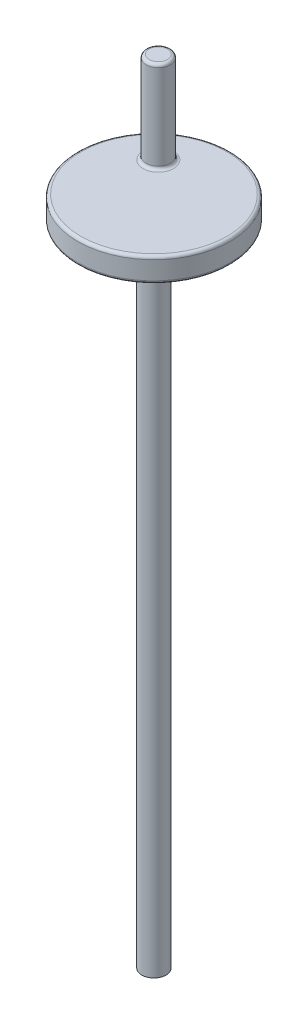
ISO-10303-21;
HEADER;
FILE_DESCRIPTION(('STEP AP214'),'2;1');
FILE_NAME('part.step','',(''),(''),'','','');
FILE_SCHEMA(('AUTOMOTIVE_DESIGN { 1 0 10303 214 1 1 1 1 }'));
ENDSEC;
DATA;
#1=APPLICATION_CONTEXT('core data for automotive mechanical design processes');
#2=APPLICATION_PROTOCOL_DEFINITION('international standard','automotive_design',2000,#1);
#3=PRODUCT_CONTEXT('',#1,'mechanical');
#4=PRODUCT('Part','Part','',(#3));
#5=PRODUCT_RELATED_PRODUCT_CATEGORY('part','',(#4));
#6=PRODUCT_DEFINITION_FORMATION('','',#4);
#7=PRODUCT_DEFINITION_CONTEXT('part definition',#1,'design');
#8=PRODUCT_DEFINITION('design','',#6,#7);
#9=PRODUCT_DEFINITION_SHAPE('','',#8);
#10=(LENGTH_UNIT() NAMED_UNIT(*) SI_UNIT(.MILLI.,.METRE.));
#11=(NAMED_UNIT(*) PLANE_ANGLE_UNIT() SI_UNIT($,.RADIAN.));
#12=(NAMED_UNIT(*) SI_UNIT($,.STERADIAN.) SOLID_ANGLE_UNIT());
#13=UNCERTAINTY_MEASURE_WITH_UNIT(LENGTH_MEASURE(1.E-05),#10,'distance_accuracy_value','');
#14=(GEOMETRIC_REPRESENTATION_CONTEXT(3) GLOBAL_UNCERTAINTY_ASSIGNED_CONTEXT((#13)) GLOBAL_UNIT_ASSIGNED_CONTEXT((#10,
#11,#12)) REPRESENTATION_CONTEXT('',''));
#15=CARTESIAN_POINT('',(0.,0.,0.));
#16=DIRECTION('',(0.,0.,1.));
#17=DIRECTION('',(1.,0.,0.));
#18=AXIS2_PLACEMENT_3D('',#15,#16,#17);
#19=CARTESIAN_POINT('',(0.,220.,0.));
#20=DIRECTION('',(0.,1.,0.));
#21=DIRECTION('',(0.,0.,1.));
#22=AXIS2_PLACEMENT_3D('',#19,#20,#21);
#23=PLANE('',#22);
#24=CARTESIAN_POINT('',(0.,220.,0.));
#25=DIRECTION('',(0.,1.,0.));
#26=DIRECTION('',(0.,0.,1.));
#27=AXIS2_PLACEMENT_3D('',#24,#25,#26);
#28=CIRCLE('',#27,24.);
#29=CARTESIAN_POINT('',(0.,220.,24.));
#30=VERTEX_POINT('',#29);
#31=EDGE_CURVE('E10',#30,#30,#28,.T.);
#32=ORIENTED_EDGE('',*,*,#31,.T.);
#33=EDGE_LOOP('',(#32));
#34=FACE_BOUND('',#33,.T.);
#35=CARTESIAN_POINT('',(-9.02736603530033,220.,-10.4682159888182));
#36=DIRECTION('',(0.,1.,0.));
#37=DIRECTION('',(0.,0.,1.));
#38=AXIS2_PLACEMENT_3D('',#35,#36,#37);
#39=CIRCLE('',#38,5.);
#40=CARTESIAN_POINT('',(-9.02736603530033,220.,-5.46821598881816));
#41=VERTEX_POINT('',#40);
#42=EDGE_CURVE('E37',#41,#41,#39,.F.);
#43=ORIENTED_EDGE('',*,*,#42,.T.);
#44=EDGE_LOOP('',(#43));
#45=FACE_BOUND('',#44,.T.);
#46=ADVANCED_FACE('F30',(#34,#45),#23,.T.);
#47=CARTESIAN_POINT('',(0.,220.,0.));
#48=DIRECTION('',(0.,-1.,0.));
#49=DIRECTION('',(0.,0.,-1.));
#50=AXIS2_PLACEMENT_3D('',#47,#48,#49);
#51=CYLINDRICAL_SURFACE('',#50,4.);
#52=CARTESIAN_POINT('',(0.,0.,0.));
#53=DIRECTION('',(0.,1.,0.));
#54=DIRECTION('',(0.,0.,1.));
#55=AXIS2_PLACEMENT_3D('',#52,#53,#54);
#56=CIRCLE('',#55,4.);
#57=CARTESIAN_POINT('',(0.,0.,4.));
#58=VERTEX_POINT('',#57);
#59=EDGE_CURVE('E65',#58,#58,#56,.T.);
#60=ORIENTED_EDGE('',*,*,#59,.T.);
#61=EDGE_LOOP('',(#60));
#62=FACE_BOUND('',#61,.T.);
#63=CARTESIAN_POINT('',(0.,212.,0.));
#64=DIRECTION('',(0.,1.,0.));
#65=DIRECTION('',(0.,0.,1.));
#66=AXIS2_PLACEMENT_3D('',#63,#64,#65);
#67=CIRCLE('',#66,4.);
#68=CARTESIAN_POINT('',(0.,212.,4.));
#69=VERTEX_POINT('',#68);
#70=EDGE_CURVE('E62',#69,#69,#67,.T.);
#71=ORIENTED_EDGE('',*,*,#70,.F.);
#72=EDGE_LOOP('',(#71));
#73=FACE_BOUND('',#72,.T.);
#74=ADVANCED_FACE('F69',(#62,#73),#51,.T.);
#75=CARTESIAN_POINT('',(0.,0.,0.));
#76=DIRECTION('',(0.,1.,0.));
#77=DIRECTION('',(0.,0.,1.));
#78=AXIS2_PLACEMENT_3D('',#75,#76,#77);
#79=PLANE('',#78);
#80=ORIENTED_EDGE('',*,*,#59,.F.);
#81=EDGE_LOOP('',(#80));
#82=FACE_BOUND('',#81,.T.);
#83=ADVANCED_FACE('F72',(#82),#79,.F.);
#84=CARTESIAN_POINT('',(0.,212.,0.));
#85=DIRECTION('',(0.,1.,0.));
#86=DIRECTION('',(0.,0.,1.));
#87=AXIS2_PLACEMENT_3D('',#84,#85,#86);
#88=PLANE('',#87);
#89=CARTESIAN_POINT('',(0.,212.,0.));
#90=DIRECTION('',(0.,1.,0.));
#91=DIRECTION('',(0.,0.,1.));
#92=AXIS2_PLACEMENT_3D('',#89,#90,#91);
#93=CIRCLE('',#92,24.);
#94=CARTESIAN_POINT('',(0.,212.,24.));
#95=VERTEX_POINT('',#94);
#96=EDGE_CURVE('E41',#95,#95,#93,.F.);
#97=ORIENTED_EDGE('',*,*,#96,.T.);
#98=EDGE_LOOP('',(#97));
#99=FACE_BOUND('',#98,.T.);
#100=ORIENTED_EDGE('',*,*,#70,.T.);
#101=EDGE_LOOP('',(#100));
#102=FACE_BOUND('',#101,.T.);
#103=ADVANCED_FACE('F74',(#99,#102),#88,.F.);
#104=CARTESIAN_POINT('',(0.,212.,0.));
#105=DIRECTION('',(0.,1.,0.));
#106=DIRECTION('',(0.,0.,1.));
#107=AXIS2_PLACEMENT_3D('',#104,#105,#106);
#108=CYLINDRICAL_SURFACE('',#107,25.);
#109=CARTESIAN_POINT('',(0.,213.,0.));
#110=DIRECTION('',(0.,1.,0.));
#111=DIRECTION('',(0.,0.,1.));
#112=AXIS2_PLACEMENT_3D('',#109,#110,#111);
#113=CIRCLE('',#112,25.);
#114=CARTESIAN_POINT('',(0.,213.,25.));
#115=VERTEX_POINT('',#114);
#116=EDGE_CURVE('E45',#115,#115,#113,.T.);
#117=ORIENTED_EDGE('',*,*,#116,.T.);
#118=EDGE_LOOP('',(#117));
#119=FACE_BOUND('',#118,.T.);
#120=CARTESIAN_POINT('',(0.,219.,0.));
#121=DIRECTION('',(0.,1.,0.));
#122=DIRECTION('',(0.,0.,1.));
#123=AXIS2_PLACEMENT_3D('',#120,#121,#122);
#124=CIRCLE('',#123,25.);
#125=CARTESIAN_POINT('',(0.,219.,25.));
#126=VERTEX_POINT('',#125);
#127=EDGE_CURVE('E50',#126,#126,#124,.F.);
#128=ORIENTED_EDGE('',*,*,#127,.T.);
#129=EDGE_LOOP('',(#128));
#130=FACE_BOUND('',#129,.T.);
#131=ADVANCED_FACE('F80',(#119,#130),#108,.T.);
#132=CARTESIAN_POINT('',(-9.02736603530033,250.,-10.4682159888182));
#133=DIRECTION('',(0.,-1.,0.));
#134=DIRECTION('',(0.,0.,-1.));
#135=AXIS2_PLACEMENT_3D('',#132,#133,#134);
#136=CYLINDRICAL_SURFACE('',#135,4.);
#137=CARTESIAN_POINT('',(-9.02736603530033,249.,-10.4682159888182));
#138=DIRECTION('',(0.,1.,0.));
#139=DIRECTION('',(0.,0.,1.));
#140=AXIS2_PLACEMENT_3D('',#137,#138,#139);
#141=CIRCLE('',#140,4.);
#142=CARTESIAN_POINT('',(-9.02736603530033,249.,-6.46821598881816));
#143=VERTEX_POINT('',#142);
#144=EDGE_CURVE('E53',#143,#143,#141,.F.);
#145=ORIENTED_EDGE('',*,*,#144,.T.);
#146=EDGE_LOOP('',(#145));
#147=FACE_BOUND('',#146,.T.);
#148=CARTESIAN_POINT('',(-9.02736603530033,221.,-10.4682159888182));
#149=DIRECTION('',(0.,1.,0.));
#150=DIRECTION('',(0.,0.,1.));
#151=AXIS2_PLACEMENT_3D('',#148,#149,#150);
#152=CIRCLE('',#151,4.);
#153=CARTESIAN_POINT('',(-9.02736603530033,221.,-6.46821598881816));
#154=VERTEX_POINT('',#153);
#155=EDGE_CURVE('E56',#154,#154,#152,.T.);
#156=ORIENTED_EDGE('',*,*,#155,.T.);
#157=EDGE_LOOP('',(#156));
#158=FACE_BOUND('',#157,.T.);
#159=ADVANCED_FACE('F90',(#147,#158),#136,.T.);
#160=CARTESIAN_POINT('',(-9.02736603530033,250.,-10.4682159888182));
#161=DIRECTION('',(0.,1.,0.));
#162=DIRECTION('',(0.,0.,1.));
#163=AXIS2_PLACEMENT_3D('',#160,#161,#162);
#164=PLANE('',#163);
#165=CARTESIAN_POINT('',(-9.02736603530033,250.,-10.4682159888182));
#166=DIRECTION('',(0.,1.,0.));
#167=DIRECTION('',(0.,0.,1.));
#168=AXIS2_PLACEMENT_3D('',#165,#166,#167);
#169=CIRCLE('',#168,3.);
#170=CARTESIAN_POINT('',(-9.02736603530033,250.,-7.46821598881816));
#171=VERTEX_POINT('',#170);
#172=EDGE_CURVE('E59',#171,#171,#169,.T.);
#173=ORIENTED_EDGE('',*,*,#172,.T.);
#174=EDGE_LOOP('',(#173));
#175=FACE_BOUND('',#174,.T.);
#176=ADVANCED_FACE('F95',(#175),#164,.T.);
#177=CARTESIAN_POINT('',(-9.02736603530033,249.,-10.4682159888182));
#178=DIRECTION('',(0.,1.,0.));
#179=DIRECTION('',(0.,0.,1.));
#180=AXIS2_PLACEMENT_3D('',#177,#178,#179);
#181=TOROIDAL_SURFACE('',#180,3.,1.);
#182=ORIENTED_EDGE('',*,*,#144,.F.);
#183=EDGE_LOOP('',(#182));
#184=FACE_BOUND('',#183,.T.);
#185=ORIENTED_EDGE('',*,*,#172,.F.);
#186=EDGE_LOOP('',(#185));
#187=FACE_BOUND('',#186,.T.);
#188=ADVANCED_FACE('F98',(#184,#187),#181,.T.);
#189=CARTESIAN_POINT('',(0.,213.,0.));
#190=DIRECTION('',(0.,1.,0.));
#191=DIRECTION('',(0.,0.,1.));
#192=AXIS2_PLACEMENT_3D('',#189,#190,#191);
#193=TOROIDAL_SURFACE('',#192,24.,1.);
#194=ORIENTED_EDGE('',*,*,#96,.F.);
#195=EDGE_LOOP('',(#194));
#196=FACE_BOUND('',#195,.T.);
#197=ORIENTED_EDGE('',*,*,#116,.F.);
#198=EDGE_LOOP('',(#197));
#199=FACE_BOUND('',#198,.T.);
#200=ADVANCED_FACE('F103',(#196,#199),#193,.T.);
#201=CARTESIAN_POINT('',(0.,219.,0.));
#202=DIRECTION('',(0.,1.,0.));
#203=DIRECTION('',(0.,0.,1.));
#204=AXIS2_PLACEMENT_3D('',#201,#202,#203);
#205=TOROIDAL_SURFACE('',#204,24.,1.);
#206=ORIENTED_EDGE('',*,*,#127,.F.);
#207=EDGE_LOOP('',(#206));
#208=FACE_BOUND('',#207,.T.);
#209=ORIENTED_EDGE('',*,*,#31,.F.);
#210=EDGE_LOOP('',(#209));
#211=FACE_BOUND('',#210,.T.);
#212=ADVANCED_FACE('F111',(#208,#211),#205,.T.);
#213=CARTESIAN_POINT('',(-9.02736603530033,221.,-10.4682159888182));
#214=DIRECTION('',(0.,1.,0.));
#215=DIRECTION('',(0.,0.,1.));
#216=AXIS2_PLACEMENT_3D('',#213,#214,#215);
#217=TOROIDAL_SURFACE('',#216,5.,1.);
#218=ORIENTED_EDGE('',*,*,#42,.F.);
#219=EDGE_LOOP('',(#218));
#220=FACE_BOUND('',#219,.T.);
#221=ORIENTED_EDGE('',*,*,#155,.F.);
#222=EDGE_LOOP('',(#221));
#223=FACE_BOUND('',#222,.T.);
#224=ADVANCED_FACE('F32',(#220,#223),#217,.F.);
#225=CLOSED_SHELL('',(#46,#74,#83,#103,#131,#159,#176,#188,#200,#212,#224));
#226=MANIFOLD_SOLID_BREP('B2',#225);
#227=ADVANCED_BREP_SHAPE_REPRESENTATION('',(#18,#226),#14);
#228=SHAPE_DEFINITION_REPRESENTATION(#9,#227);
ENDSEC;
END-ISO-10303-21;
